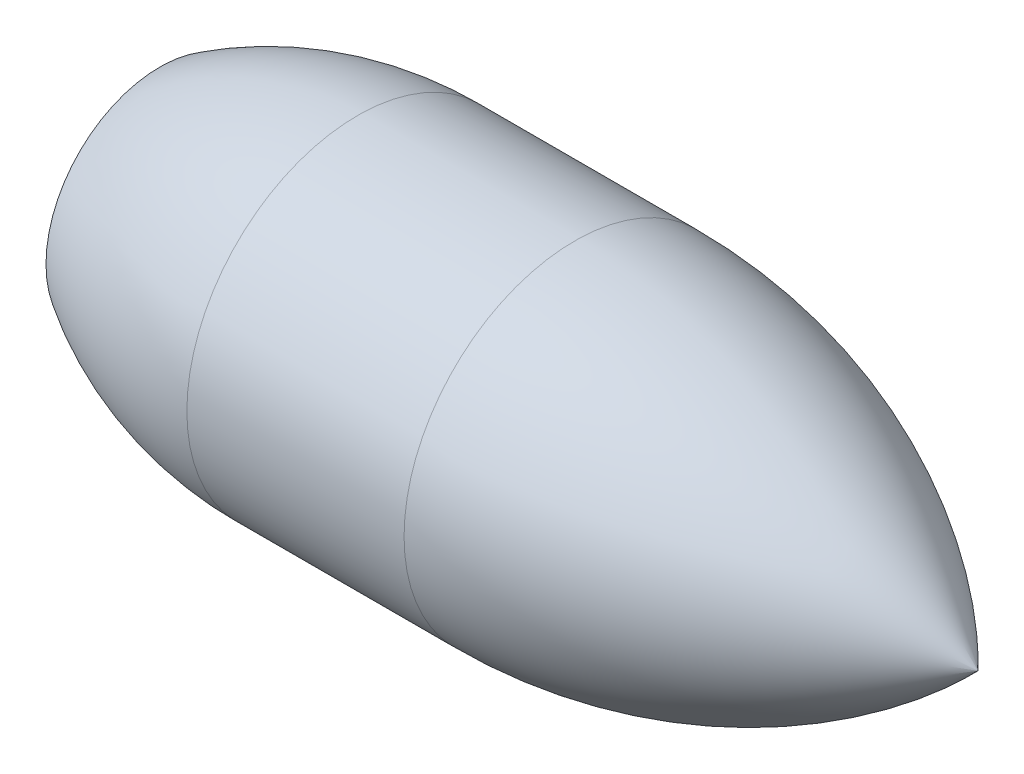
from build123d import *

# Parameters (mm, degrees)
SKETCH2_R          = 18.288
EXTRUDE1_DEPTH     = 87.63
SKETCH5_R          = 7.9375
CUT_EXTRUDE2_DEPTH = 24.13


with BuildPart() as part:
    # Sketch2 → Extrude1 (new body)
    with BuildSketch(Plane(origin=(0, 0, 0), x_dir=(0, 0, -1), z_dir=(1, 0, 0))):
        Circle(SKETCH2_R)
    extrude(amount=EXTRUDE1_DEPTH)

    # Sketch3 → shape (revolve, cut)
    with BuildSketch(Plane.XY, mode=Mode.PRIVATE) as shape_sk:
        with BuildLine():
            Line((87.63, 0.008772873), (87.63, 18.288))
            Line((87.63, 18.288), (44.45, 18.288))
            ThreePointArc((44.45, 18.288), (67.89484242, 13.529977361), (87.63, 0.008772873))
        make_face()
        with BuildLine():
            Line((21.184856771, 18.288), (0, 18.288))
            Line((0, 18.288), (0, 12.192))
            ThreePointArc((0, 12.192), (10.162613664, 16.733694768), (21.184856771, 18.288))
        make_face()
    revolve(shape_sk.sketch.rotate(Axis((0, 0, 0), (1, 0, 0)), 90), axis=Axis((0, 0, 0), (1, 0, 0)), mode=Mode.SUBTRACT)

    # Sketch5 → Cut-Extrude2 (cut)
    with BuildSketch(Plane.ZY):
        Circle(SKETCH5_R)
    extrude(amount=-CUT_EXTRUDE2_DEPTH, mode=Mode.SUBTRACT)


solid = part.part
